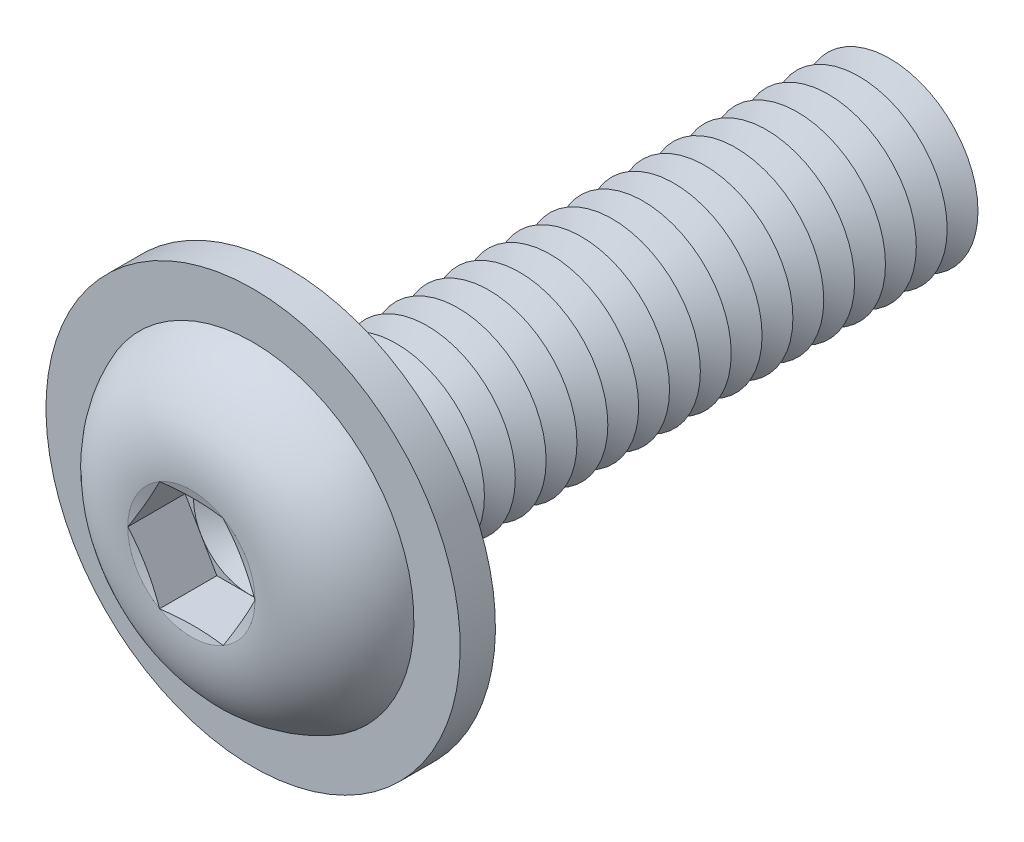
ISO-10303-21;
HEADER;
FILE_DESCRIPTION(('STEP AP214'),'2;1');
FILE_NAME('part.step','',(''),(''),'','','');
FILE_SCHEMA(('AUTOMOTIVE_DESIGN { 1 0 10303 214 1 1 1 1 }'));
ENDSEC;
DATA;
#1=APPLICATION_CONTEXT('core data for automotive mechanical design processes');
#2=APPLICATION_PROTOCOL_DEFINITION('international standard','automotive_design',2000,#1);
#3=PRODUCT_CONTEXT('',#1,'mechanical');
#4=PRODUCT('Part','Part','',(#3));
#5=PRODUCT_RELATED_PRODUCT_CATEGORY('part','',(#4));
#6=PRODUCT_DEFINITION_FORMATION('','',#4);
#7=PRODUCT_DEFINITION_CONTEXT('part definition',#1,'design');
#8=PRODUCT_DEFINITION('design','',#6,#7);
#9=PRODUCT_DEFINITION_SHAPE('','',#8);
#10=(LENGTH_UNIT() NAMED_UNIT(*) SI_UNIT(.MILLI.,.METRE.));
#11=(NAMED_UNIT(*) PLANE_ANGLE_UNIT() SI_UNIT($,.RADIAN.));
#12=(NAMED_UNIT(*) SI_UNIT($,.STERADIAN.) SOLID_ANGLE_UNIT());
#13=UNCERTAINTY_MEASURE_WITH_UNIT(LENGTH_MEASURE(1.E-05),#10,'distance_accuracy_value','');
#14=(GEOMETRIC_REPRESENTATION_CONTEXT(3) GLOBAL_UNCERTAINTY_ASSIGNED_CONTEXT((#13)) GLOBAL_UNIT_ASSIGNED_CONTEXT((#10,
#11,#12)) REPRESENTATION_CONTEXT('',''));
#15=CARTESIAN_POINT('',(0.,0.,0.));
#16=DIRECTION('',(0.,0.,1.));
#17=DIRECTION('',(1.,0.,0.));
#18=AXIS2_PLACEMENT_3D('',#15,#16,#17);
#19=CARTESIAN_POINT('',(0.,0.,-11.55));
#20=DIRECTION('',(0.,0.,1.));
#21=DIRECTION('',(1.,0.,0.));
#22=AXIS2_PLACEMENT_3D('',#19,#20,#21);
#23=CONICAL_SURFACE('',#22,2.,1.0471975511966);
#24=CARTESIAN_POINT('',(0.,0.,-11.9));
#25=DIRECTION('',(0.,0.,1.));
#26=DIRECTION('',(1.,0.,0.));
#27=AXIS2_PLACEMENT_3D('',#24,#25,#26);
#28=CIRCLE('',#27,1.3937822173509);
#29=CARTESIAN_POINT('',(1.3937822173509,0.,-11.9));
#30=VERTEX_POINT('',#29);
#31=EDGE_CURVE('E370',#30,#30,#28,.T.);
#32=ORIENTED_EDGE('',*,*,#31,.T.);
#33=EDGE_LOOP('',(#32));
#34=FACE_BOUND('',#33,.T.);
#35=CARTESIAN_POINT('',(0.,0.,-11.55));
#36=DIRECTION('',(0.,0.,1.));
#37=DIRECTION('',(1.,0.,0.));
#38=AXIS2_PLACEMENT_3D('',#35,#36,#37);
#39=CIRCLE('',#38,2.);
#40=CARTESIAN_POINT('',(2.,0.,-11.55));
#41=VERTEX_POINT('',#40);
#42=EDGE_CURVE('E366',#41,#41,#39,.T.);
#43=ORIENTED_EDGE('',*,*,#42,.F.);
#44=EDGE_LOOP('',(#43));
#45=FACE_BOUND('',#44,.T.);
#46=ADVANCED_FACE('F39',(#34,#45),#23,.T.);
#47=CARTESIAN_POINT('',(0.,0.,-11.9));
#48=DIRECTION('',(0.,0.,-1.));
#49=DIRECTION('',(-1.,0.,0.));
#50=AXIS2_PLACEMENT_3D('',#47,#48,#49);
#51=CONICAL_SURFACE('',#50,1.3937822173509,1.0471975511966);
#52=CARTESIAN_POINT('',(0.,0.,-12.25));
#53=DIRECTION('',(0.,0.,1.));
#54=DIRECTION('',(1.,0.,0.));
#55=AXIS2_PLACEMENT_3D('',#52,#53,#54);
#56=CIRCLE('',#55,2.);
#57=CARTESIAN_POINT('',(2.,0.,-12.25));
#58=VERTEX_POINT('',#57);
#59=EDGE_CURVE('E374',#58,#58,#56,.T.);
#60=ORIENTED_EDGE('',*,*,#59,.T.);
#61=EDGE_LOOP('',(#60));
#62=FACE_BOUND('',#61,.T.);
#63=ORIENTED_EDGE('',*,*,#31,.F.);
#64=EDGE_LOOP('',(#63));
#65=FACE_BOUND('',#64,.T.);
#66=ADVANCED_FACE('F486',(#62,#65),#51,.T.);
#67=CARTESIAN_POINT('',(0.,2.00000000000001,-14.));
#68=DIRECTION('',(0.,0.,-1.));
#69=DIRECTION('',(-1.,0.,0.));
#70=AXIS2_PLACEMENT_3D('',#67,#68,#69);
#71=PLANE('',#70);
#72=CARTESIAN_POINT('',(0.,0.,-14.));
#73=DIRECTION('',(0.,0.,1.));
#74=DIRECTION('',(1.,0.,0.));
#75=AXIS2_PLACEMENT_3D('',#72,#73,#74);
#76=CIRCLE('',#75,1.3937822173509);
#77=CARTESIAN_POINT('',(1.3937822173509,0.,-14.));
#78=VERTEX_POINT('',#77);
#79=EDGE_CURVE('E394',#78,#78,#76,.T.);
#80=ORIENTED_EDGE('',*,*,#79,.F.);
#81=EDGE_LOOP('',(#80));
#82=FACE_BOUND('',#81,.T.);
#83=ADVANCED_FACE('F492',(#82),#71,.T.);
#84=CARTESIAN_POINT('',(0.,0.,-13.65));
#85=DIRECTION('',(0.,0.,1.));
#86=DIRECTION('',(1.,0.,0.));
#87=AXIS2_PLACEMENT_3D('',#84,#85,#86);
#88=CONICAL_SURFACE('',#87,2.,1.0471975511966);
#89=ORIENTED_EDGE('',*,*,#79,.T.);
#90=EDGE_LOOP('',(#89));
#91=FACE_BOUND('',#90,.T.);
#92=CARTESIAN_POINT('',(0.,0.,-13.65));
#93=DIRECTION('',(0.,0.,1.));
#94=DIRECTION('',(1.,0.,0.));
#95=AXIS2_PLACEMENT_3D('',#92,#93,#94);
#96=CIRCLE('',#95,2.);
#97=CARTESIAN_POINT('',(2.,0.,-13.65));
#98=VERTEX_POINT('',#97);
#99=EDGE_CURVE('E390',#98,#98,#96,.T.);
#100=ORIENTED_EDGE('',*,*,#99,.F.);
#101=EDGE_LOOP('',(#100));
#102=FACE_BOUND('',#101,.T.);
#103=ADVANCED_FACE('F511',(#91,#102),#88,.T.);
#104=CARTESIAN_POINT('',(0.,0.,-13.3));
#105=DIRECTION('',(0.,0.,-1.));
#106=DIRECTION('',(-1.,0.,0.));
#107=AXIS2_PLACEMENT_3D('',#104,#105,#106);
#108=CONICAL_SURFACE('',#107,1.3937822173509,1.0471975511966);
#109=ORIENTED_EDGE('',*,*,#99,.T.);
#110=EDGE_LOOP('',(#109));
#111=FACE_BOUND('',#110,.T.);
#112=CARTESIAN_POINT('',(0.,0.,-13.3));
#113=DIRECTION('',(0.,0.,1.));
#114=DIRECTION('',(1.,0.,0.));
#115=AXIS2_PLACEMENT_3D('',#112,#113,#114);
#116=CIRCLE('',#115,1.3937822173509);
#117=CARTESIAN_POINT('',(1.3937822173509,0.,-13.3));
#118=VERTEX_POINT('',#117);
#119=EDGE_CURVE('E386',#118,#118,#116,.T.);
#120=ORIENTED_EDGE('',*,*,#119,.F.);
#121=EDGE_LOOP('',(#120));
#122=FACE_BOUND('',#121,.T.);
#123=ADVANCED_FACE('F508',(#111,#122),#108,.T.);
#124=CARTESIAN_POINT('',(0.,0.,-12.95));
#125=DIRECTION('',(0.,0.,1.));
#126=DIRECTION('',(1.,0.,0.));
#127=AXIS2_PLACEMENT_3D('',#124,#125,#126);
#128=CONICAL_SURFACE('',#127,2.,1.0471975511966);
#129=ORIENTED_EDGE('',*,*,#119,.T.);
#130=EDGE_LOOP('',(#129));
#131=FACE_BOUND('',#130,.T.);
#132=CARTESIAN_POINT('',(0.,0.,-12.95));
#133=DIRECTION('',(0.,0.,1.));
#134=DIRECTION('',(1.,0.,0.));
#135=AXIS2_PLACEMENT_3D('',#132,#133,#134);
#136=CIRCLE('',#135,2.);
#137=CARTESIAN_POINT('',(2.,0.,-12.95));
#138=VERTEX_POINT('',#137);
#139=EDGE_CURVE('E382',#138,#138,#136,.T.);
#140=ORIENTED_EDGE('',*,*,#139,.F.);
#141=EDGE_LOOP('',(#140));
#142=FACE_BOUND('',#141,.T.);
#143=ADVANCED_FACE('F502',(#131,#142),#128,.T.);
#144=CARTESIAN_POINT('',(0.,0.,-12.6));
#145=DIRECTION('',(0.,0.,-1.));
#146=DIRECTION('',(-1.,0.,0.));
#147=AXIS2_PLACEMENT_3D('',#144,#145,#146);
#148=CONICAL_SURFACE('',#147,1.3937822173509,1.0471975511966);
#149=ORIENTED_EDGE('',*,*,#139,.T.);
#150=EDGE_LOOP('',(#149));
#151=FACE_BOUND('',#150,.T.);
#152=CARTESIAN_POINT('',(0.,0.,-12.6));
#153=DIRECTION('',(0.,0.,1.));
#154=DIRECTION('',(1.,0.,0.));
#155=AXIS2_PLACEMENT_3D('',#152,#153,#154);
#156=CIRCLE('',#155,1.3937822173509);
#157=CARTESIAN_POINT('',(1.3937822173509,0.,-12.6));
#158=VERTEX_POINT('',#157);
#159=EDGE_CURVE('E378',#158,#158,#156,.T.);
#160=ORIENTED_EDGE('',*,*,#159,.F.);
#161=EDGE_LOOP('',(#160));
#162=FACE_BOUND('',#161,.T.);
#163=ADVANCED_FACE('F498',(#151,#162),#148,.T.);
#164=CARTESIAN_POINT('',(0.,0.,-12.25));
#165=DIRECTION('',(0.,0.,1.));
#166=DIRECTION('',(1.,0.,0.));
#167=AXIS2_PLACEMENT_3D('',#164,#165,#166);
#168=CONICAL_SURFACE('',#167,2.,1.0471975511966);
#169=ORIENTED_EDGE('',*,*,#159,.T.);
#170=EDGE_LOOP('',(#169));
#171=FACE_BOUND('',#170,.T.);
#172=ORIENTED_EDGE('',*,*,#59,.F.);
#173=EDGE_LOOP('',(#172));
#174=FACE_BOUND('',#173,.T.);
#175=ADVANCED_FACE('F501',(#171,#174),#168,.T.);
#176=CARTESIAN_POINT('',(0.,0.,-10.85));
#177=DIRECTION('',(0.,0.,1.));
#178=DIRECTION('',(1.,0.,0.));
#179=AXIS2_PLACEMENT_3D('',#176,#177,#178);
#180=CONICAL_SURFACE('',#179,2.,1.0471975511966);
#181=CARTESIAN_POINT('',(0.,0.,-11.2));
#182=DIRECTION('',(0.,0.,1.));
#183=DIRECTION('',(1.,0.,0.));
#184=AXIS2_PLACEMENT_3D('',#181,#182,#183);
#185=CIRCLE('',#184,1.3937822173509);
#186=CARTESIAN_POINT('',(1.3937822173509,0.,-11.2));
#187=VERTEX_POINT('',#186);
#188=EDGE_CURVE('E362',#187,#187,#185,.T.);
#189=ORIENTED_EDGE('',*,*,#188,.T.);
#190=EDGE_LOOP('',(#189));
#191=FACE_BOUND('',#190,.T.);
#192=CARTESIAN_POINT('',(0.,0.,-10.85));
#193=DIRECTION('',(0.,0.,1.));
#194=DIRECTION('',(1.,0.,0.));
#195=AXIS2_PLACEMENT_3D('',#192,#193,#194);
#196=CIRCLE('',#195,2.);
#197=CARTESIAN_POINT('',(2.,0.,-10.85));
#198=VERTEX_POINT('',#197);
#199=EDGE_CURVE('E358',#198,#198,#196,.T.);
#200=ORIENTED_EDGE('',*,*,#199,.F.);
#201=EDGE_LOOP('',(#200));
#202=FACE_BOUND('',#201,.T.);
#203=ADVANCED_FACE('F506',(#191,#202),#180,.T.);
#204=CARTESIAN_POINT('',(0.,0.,-11.2));
#205=DIRECTION('',(0.,0.,-1.));
#206=DIRECTION('',(-1.,0.,0.));
#207=AXIS2_PLACEMENT_3D('',#204,#205,#206);
#208=CONICAL_SURFACE('',#207,1.3937822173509,1.0471975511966);
#209=ORIENTED_EDGE('',*,*,#42,.T.);
#210=EDGE_LOOP('',(#209));
#211=FACE_BOUND('',#210,.T.);
#212=ORIENTED_EDGE('',*,*,#188,.F.);
#213=EDGE_LOOP('',(#212));
#214=FACE_BOUND('',#213,.T.);
#215=ADVANCED_FACE('F557',(#211,#214),#208,.T.);
#216=CARTESIAN_POINT('',(0.,0.,-10.15));
#217=DIRECTION('',(0.,0.,1.));
#218=DIRECTION('',(1.,0.,0.));
#219=AXIS2_PLACEMENT_3D('',#216,#217,#218);
#220=CONICAL_SURFACE('',#219,2.,1.0471975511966);
#221=CARTESIAN_POINT('',(0.,0.,-10.5));
#222=DIRECTION('',(0.,0.,1.));
#223=DIRECTION('',(1.,0.,0.));
#224=AXIS2_PLACEMENT_3D('',#221,#222,#223);
#225=CIRCLE('',#224,1.3937822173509);
#226=CARTESIAN_POINT('',(1.3937822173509,0.,-10.5));
#227=VERTEX_POINT('',#226);
#228=EDGE_CURVE('E354',#227,#227,#225,.T.);
#229=ORIENTED_EDGE('',*,*,#228,.T.);
#230=EDGE_LOOP('',(#229));
#231=FACE_BOUND('',#230,.T.);
#232=CARTESIAN_POINT('',(0.,0.,-10.15));
#233=DIRECTION('',(0.,0.,1.));
#234=DIRECTION('',(1.,0.,0.));
#235=AXIS2_PLACEMENT_3D('',#232,#233,#234);
#236=CIRCLE('',#235,2.);
#237=CARTESIAN_POINT('',(2.,0.,-10.15));
#238=VERTEX_POINT('',#237);
#239=EDGE_CURVE('E350',#238,#238,#236,.T.);
#240=ORIENTED_EDGE('',*,*,#239,.F.);
#241=EDGE_LOOP('',(#240));
#242=FACE_BOUND('',#241,.T.);
#243=ADVANCED_FACE('F563',(#231,#242),#220,.T.);
#244=CARTESIAN_POINT('',(0.,0.,-10.5));
#245=DIRECTION('',(0.,0.,-1.));
#246=DIRECTION('',(-1.,0.,0.));
#247=AXIS2_PLACEMENT_3D('',#244,#245,#246);
#248=CONICAL_SURFACE('',#247,1.3937822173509,1.0471975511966);
#249=ORIENTED_EDGE('',*,*,#199,.T.);
#250=EDGE_LOOP('',(#249));
#251=FACE_BOUND('',#250,.T.);
#252=ORIENTED_EDGE('',*,*,#228,.F.);
#253=EDGE_LOOP('',(#252));
#254=FACE_BOUND('',#253,.T.);
#255=ADVANCED_FACE('F570',(#251,#254),#248,.T.);
#256=CARTESIAN_POINT('',(0.,0.,-9.45));
#257=DIRECTION('',(0.,0.,1.));
#258=DIRECTION('',(1.,0.,0.));
#259=AXIS2_PLACEMENT_3D('',#256,#257,#258);
#260=CONICAL_SURFACE('',#259,2.,1.0471975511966);
#261=CARTESIAN_POINT('',(0.,0.,-9.8));
#262=DIRECTION('',(0.,0.,1.));
#263=DIRECTION('',(1.,0.,0.));
#264=AXIS2_PLACEMENT_3D('',#261,#262,#263);
#265=CIRCLE('',#264,1.3937822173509);
#266=CARTESIAN_POINT('',(1.3937822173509,0.,-9.8));
#267=VERTEX_POINT('',#266);
#268=EDGE_CURVE('E346',#267,#267,#265,.T.);
#269=ORIENTED_EDGE('',*,*,#268,.T.);
#270=EDGE_LOOP('',(#269));
#271=FACE_BOUND('',#270,.T.);
#272=CARTESIAN_POINT('',(0.,0.,-9.45));
#273=DIRECTION('',(0.,0.,1.));
#274=DIRECTION('',(1.,0.,0.));
#275=AXIS2_PLACEMENT_3D('',#272,#273,#274);
#276=CIRCLE('',#275,2.);
#277=CARTESIAN_POINT('',(2.,0.,-9.45));
#278=VERTEX_POINT('',#277);
#279=EDGE_CURVE('E342',#278,#278,#276,.T.);
#280=ORIENTED_EDGE('',*,*,#279,.F.);
#281=EDGE_LOOP('',(#280));
#282=FACE_BOUND('',#281,.T.);
#283=ADVANCED_FACE('F577',(#271,#282),#260,.T.);
#284=CARTESIAN_POINT('',(0.,0.,-9.8));
#285=DIRECTION('',(0.,0.,-1.));
#286=DIRECTION('',(-1.,0.,0.));
#287=AXIS2_PLACEMENT_3D('',#284,#285,#286);
#288=CONICAL_SURFACE('',#287,1.3937822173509,1.0471975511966);
#289=ORIENTED_EDGE('',*,*,#239,.T.);
#290=EDGE_LOOP('',(#289));
#291=FACE_BOUND('',#290,.T.);
#292=ORIENTED_EDGE('',*,*,#268,.F.);
#293=EDGE_LOOP('',(#292));
#294=FACE_BOUND('',#293,.T.);
#295=ADVANCED_FACE('F584',(#291,#294),#288,.T.);
#296=CARTESIAN_POINT('',(0.,0.,-8.75));
#297=DIRECTION('',(0.,0.,1.));
#298=DIRECTION('',(1.,0.,0.));
#299=AXIS2_PLACEMENT_3D('',#296,#297,#298);
#300=CONICAL_SURFACE('',#299,2.,1.0471975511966);
#301=CARTESIAN_POINT('',(0.,0.,-9.1));
#302=DIRECTION('',(0.,0.,1.));
#303=DIRECTION('',(1.,0.,0.));
#304=AXIS2_PLACEMENT_3D('',#301,#302,#303);
#305=CIRCLE('',#304,1.3937822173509);
#306=CARTESIAN_POINT('',(1.3937822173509,0.,-9.1));
#307=VERTEX_POINT('',#306);
#308=EDGE_CURVE('E338',#307,#307,#305,.T.);
#309=ORIENTED_EDGE('',*,*,#308,.T.);
#310=EDGE_LOOP('',(#309));
#311=FACE_BOUND('',#310,.T.);
#312=CARTESIAN_POINT('',(0.,0.,-8.75));
#313=DIRECTION('',(0.,0.,1.));
#314=DIRECTION('',(1.,0.,0.));
#315=AXIS2_PLACEMENT_3D('',#312,#313,#314);
#316=CIRCLE('',#315,2.);
#317=CARTESIAN_POINT('',(2.,0.,-8.75));
#318=VERTEX_POINT('',#317);
#319=EDGE_CURVE('E334',#318,#318,#316,.T.);
#320=ORIENTED_EDGE('',*,*,#319,.F.);
#321=EDGE_LOOP('',(#320));
#322=FACE_BOUND('',#321,.T.);
#323=ADVANCED_FACE('F591',(#311,#322),#300,.T.);
#324=CARTESIAN_POINT('',(0.,0.,-9.1));
#325=DIRECTION('',(0.,0.,-1.));
#326=DIRECTION('',(-1.,0.,0.));
#327=AXIS2_PLACEMENT_3D('',#324,#325,#326);
#328=CONICAL_SURFACE('',#327,1.3937822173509,1.0471975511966);
#329=ORIENTED_EDGE('',*,*,#279,.T.);
#330=EDGE_LOOP('',(#329));
#331=FACE_BOUND('',#330,.T.);
#332=ORIENTED_EDGE('',*,*,#308,.F.);
#333=EDGE_LOOP('',(#332));
#334=FACE_BOUND('',#333,.T.);
#335=ADVANCED_FACE('F598',(#331,#334),#328,.T.);
#336=CARTESIAN_POINT('',(0.,0.,-8.05));
#337=DIRECTION('',(0.,0.,1.));
#338=DIRECTION('',(1.,0.,0.));
#339=AXIS2_PLACEMENT_3D('',#336,#337,#338);
#340=CONICAL_SURFACE('',#339,2.,1.0471975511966);
#341=CARTESIAN_POINT('',(0.,0.,-8.4));
#342=DIRECTION('',(0.,0.,1.));
#343=DIRECTION('',(1.,0.,0.));
#344=AXIS2_PLACEMENT_3D('',#341,#342,#343);
#345=CIRCLE('',#344,1.3937822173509);
#346=CARTESIAN_POINT('',(1.3937822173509,0.,-8.4));
#347=VERTEX_POINT('',#346);
#348=EDGE_CURVE('E330',#347,#347,#345,.T.);
#349=ORIENTED_EDGE('',*,*,#348,.T.);
#350=EDGE_LOOP('',(#349));
#351=FACE_BOUND('',#350,.T.);
#352=CARTESIAN_POINT('',(0.,0.,-8.05));
#353=DIRECTION('',(0.,0.,1.));
#354=DIRECTION('',(1.,0.,0.));
#355=AXIS2_PLACEMENT_3D('',#352,#353,#354);
#356=CIRCLE('',#355,2.);
#357=CARTESIAN_POINT('',(2.,0.,-8.05));
#358=VERTEX_POINT('',#357);
#359=EDGE_CURVE('E326',#358,#358,#356,.T.);
#360=ORIENTED_EDGE('',*,*,#359,.F.);
#361=EDGE_LOOP('',(#360));
#362=FACE_BOUND('',#361,.T.);
#363=ADVANCED_FACE('F605',(#351,#362),#340,.T.);
#364=CARTESIAN_POINT('',(0.,0.,-8.4));
#365=DIRECTION('',(0.,0.,-1.));
#366=DIRECTION('',(-1.,0.,0.));
#367=AXIS2_PLACEMENT_3D('',#364,#365,#366);
#368=CONICAL_SURFACE('',#367,1.3937822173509,1.0471975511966);
#369=ORIENTED_EDGE('',*,*,#319,.T.);
#370=EDGE_LOOP('',(#369));
#371=FACE_BOUND('',#370,.T.);
#372=ORIENTED_EDGE('',*,*,#348,.F.);
#373=EDGE_LOOP('',(#372));
#374=FACE_BOUND('',#373,.T.);
#375=ADVANCED_FACE('F612',(#371,#374),#368,.T.);
#376=CARTESIAN_POINT('',(0.,0.,-7.35));
#377=DIRECTION('',(0.,0.,1.));
#378=DIRECTION('',(1.,0.,0.));
#379=AXIS2_PLACEMENT_3D('',#376,#377,#378);
#380=CONICAL_SURFACE('',#379,2.,1.0471975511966);
#381=CARTESIAN_POINT('',(0.,0.,-7.7));
#382=DIRECTION('',(0.,0.,1.));
#383=DIRECTION('',(1.,0.,0.));
#384=AXIS2_PLACEMENT_3D('',#381,#382,#383);
#385=CIRCLE('',#384,1.3937822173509);
#386=CARTESIAN_POINT('',(1.3937822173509,0.,-7.7));
#387=VERTEX_POINT('',#386);
#388=EDGE_CURVE('E322',#387,#387,#385,.T.);
#389=ORIENTED_EDGE('',*,*,#388,.T.);
#390=EDGE_LOOP('',(#389));
#391=FACE_BOUND('',#390,.T.);
#392=CARTESIAN_POINT('',(0.,0.,-7.35));
#393=DIRECTION('',(0.,0.,1.));
#394=DIRECTION('',(1.,0.,0.));
#395=AXIS2_PLACEMENT_3D('',#392,#393,#394);
#396=CIRCLE('',#395,2.);
#397=CARTESIAN_POINT('',(2.,0.,-7.35));
#398=VERTEX_POINT('',#397);
#399=EDGE_CURVE('E318',#398,#398,#396,.T.);
#400=ORIENTED_EDGE('',*,*,#399,.F.);
#401=EDGE_LOOP('',(#400));
#402=FACE_BOUND('',#401,.T.);
#403=ADVANCED_FACE('F619',(#391,#402),#380,.T.);
#404=CARTESIAN_POINT('',(0.,0.,-7.7));
#405=DIRECTION('',(0.,0.,-1.));
#406=DIRECTION('',(-1.,0.,0.));
#407=AXIS2_PLACEMENT_3D('',#404,#405,#406);
#408=CONICAL_SURFACE('',#407,1.3937822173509,1.0471975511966);
#409=ORIENTED_EDGE('',*,*,#359,.T.);
#410=EDGE_LOOP('',(#409));
#411=FACE_BOUND('',#410,.T.);
#412=ORIENTED_EDGE('',*,*,#388,.F.);
#413=EDGE_LOOP('',(#412));
#414=FACE_BOUND('',#413,.T.);
#415=ADVANCED_FACE('F626',(#411,#414),#408,.T.);
#416=CARTESIAN_POINT('',(0.,0.,-6.65));
#417=DIRECTION('',(0.,0.,1.));
#418=DIRECTION('',(1.,0.,0.));
#419=AXIS2_PLACEMENT_3D('',#416,#417,#418);
#420=CONICAL_SURFACE('',#419,2.,1.0471975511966);
#421=CARTESIAN_POINT('',(0.,0.,-7.));
#422=DIRECTION('',(0.,0.,1.));
#423=DIRECTION('',(1.,0.,0.));
#424=AXIS2_PLACEMENT_3D('',#421,#422,#423);
#425=CIRCLE('',#424,1.3937822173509);
#426=CARTESIAN_POINT('',(1.3937822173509,0.,-7.));
#427=VERTEX_POINT('',#426);
#428=EDGE_CURVE('E314',#427,#427,#425,.T.);
#429=ORIENTED_EDGE('',*,*,#428,.T.);
#430=EDGE_LOOP('',(#429));
#431=FACE_BOUND('',#430,.T.);
#432=CARTESIAN_POINT('',(0.,0.,-6.65));
#433=DIRECTION('',(0.,0.,1.));
#434=DIRECTION('',(1.,0.,0.));
#435=AXIS2_PLACEMENT_3D('',#432,#433,#434);
#436=CIRCLE('',#435,2.);
#437=CARTESIAN_POINT('',(2.,0.,-6.65));
#438=VERTEX_POINT('',#437);
#439=EDGE_CURVE('E310',#438,#438,#436,.T.);
#440=ORIENTED_EDGE('',*,*,#439,.F.);
#441=EDGE_LOOP('',(#440));
#442=FACE_BOUND('',#441,.T.);
#443=ADVANCED_FACE('F633',(#431,#442),#420,.T.);
#444=CARTESIAN_POINT('',(0.,0.,-7.));
#445=DIRECTION('',(0.,0.,-1.));
#446=DIRECTION('',(-1.,0.,0.));
#447=AXIS2_PLACEMENT_3D('',#444,#445,#446);
#448=CONICAL_SURFACE('',#447,1.3937822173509,1.0471975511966);
#449=ORIENTED_EDGE('',*,*,#399,.T.);
#450=EDGE_LOOP('',(#449));
#451=FACE_BOUND('',#450,.T.);
#452=ORIENTED_EDGE('',*,*,#428,.F.);
#453=EDGE_LOOP('',(#452));
#454=FACE_BOUND('',#453,.T.);
#455=ADVANCED_FACE('F640',(#451,#454),#448,.T.);
#456=CARTESIAN_POINT('',(0.,0.,-5.95));
#457=DIRECTION('',(0.,0.,1.));
#458=DIRECTION('',(1.,0.,0.));
#459=AXIS2_PLACEMENT_3D('',#456,#457,#458);
#460=CONICAL_SURFACE('',#459,2.,1.0471975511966);
#461=CARTESIAN_POINT('',(0.,0.,-6.3));
#462=DIRECTION('',(0.,0.,1.));
#463=DIRECTION('',(1.,0.,0.));
#464=AXIS2_PLACEMENT_3D('',#461,#462,#463);
#465=CIRCLE('',#464,1.3937822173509);
#466=CARTESIAN_POINT('',(1.3937822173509,0.,-6.3));
#467=VERTEX_POINT('',#466);
#468=EDGE_CURVE('E306',#467,#467,#465,.T.);
#469=ORIENTED_EDGE('',*,*,#468,.T.);
#470=EDGE_LOOP('',(#469));
#471=FACE_BOUND('',#470,.T.);
#472=CARTESIAN_POINT('',(0.,0.,-5.95));
#473=DIRECTION('',(0.,0.,1.));
#474=DIRECTION('',(1.,0.,0.));
#475=AXIS2_PLACEMENT_3D('',#472,#473,#474);
#476=CIRCLE('',#475,2.);
#477=CARTESIAN_POINT('',(2.,0.,-5.95));
#478=VERTEX_POINT('',#477);
#479=EDGE_CURVE('E302',#478,#478,#476,.T.);
#480=ORIENTED_EDGE('',*,*,#479,.F.);
#481=EDGE_LOOP('',(#480));
#482=FACE_BOUND('',#481,.T.);
#483=ADVANCED_FACE('F647',(#471,#482),#460,.T.);
#484=CARTESIAN_POINT('',(0.,0.,-6.3));
#485=DIRECTION('',(0.,0.,-1.));
#486=DIRECTION('',(-1.,0.,0.));
#487=AXIS2_PLACEMENT_3D('',#484,#485,#486);
#488=CONICAL_SURFACE('',#487,1.3937822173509,1.0471975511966);
#489=ORIENTED_EDGE('',*,*,#439,.T.);
#490=EDGE_LOOP('',(#489));
#491=FACE_BOUND('',#490,.T.);
#492=ORIENTED_EDGE('',*,*,#468,.F.);
#493=EDGE_LOOP('',(#492));
#494=FACE_BOUND('',#493,.T.);
#495=ADVANCED_FACE('F654',(#491,#494),#488,.T.);
#496=CARTESIAN_POINT('',(0.,0.,-5.25));
#497=DIRECTION('',(0.,0.,1.));
#498=DIRECTION('',(1.,0.,0.));
#499=AXIS2_PLACEMENT_3D('',#496,#497,#498);
#500=CONICAL_SURFACE('',#499,2.,1.0471975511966);
#501=CARTESIAN_POINT('',(0.,0.,-5.6));
#502=DIRECTION('',(0.,0.,1.));
#503=DIRECTION('',(1.,0.,0.));
#504=AXIS2_PLACEMENT_3D('',#501,#502,#503);
#505=CIRCLE('',#504,1.3937822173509);
#506=CARTESIAN_POINT('',(1.3937822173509,0.,-5.6));
#507=VERTEX_POINT('',#506);
#508=EDGE_CURVE('E298',#507,#507,#505,.T.);
#509=ORIENTED_EDGE('',*,*,#508,.T.);
#510=EDGE_LOOP('',(#509));
#511=FACE_BOUND('',#510,.T.);
#512=CARTESIAN_POINT('',(0.,0.,-5.25));
#513=DIRECTION('',(0.,0.,1.));
#514=DIRECTION('',(1.,0.,0.));
#515=AXIS2_PLACEMENT_3D('',#512,#513,#514);
#516=CIRCLE('',#515,2.);
#517=CARTESIAN_POINT('',(2.,0.,-5.25));
#518=VERTEX_POINT('',#517);
#519=EDGE_CURVE('E294',#518,#518,#516,.T.);
#520=ORIENTED_EDGE('',*,*,#519,.F.);
#521=EDGE_LOOP('',(#520));
#522=FACE_BOUND('',#521,.T.);
#523=ADVANCED_FACE('F661',(#511,#522),#500,.T.);
#524=CARTESIAN_POINT('',(0.,0.,-5.6));
#525=DIRECTION('',(0.,0.,-1.));
#526=DIRECTION('',(-1.,0.,0.));
#527=AXIS2_PLACEMENT_3D('',#524,#525,#526);
#528=CONICAL_SURFACE('',#527,1.3937822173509,1.0471975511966);
#529=ORIENTED_EDGE('',*,*,#479,.T.);
#530=EDGE_LOOP('',(#529));
#531=FACE_BOUND('',#530,.T.);
#532=ORIENTED_EDGE('',*,*,#508,.F.);
#533=EDGE_LOOP('',(#532));
#534=FACE_BOUND('',#533,.T.);
#535=ADVANCED_FACE('F668',(#531,#534),#528,.T.);
#536=CARTESIAN_POINT('',(0.,0.,-4.55));
#537=DIRECTION('',(0.,0.,1.));
#538=DIRECTION('',(1.,0.,0.));
#539=AXIS2_PLACEMENT_3D('',#536,#537,#538);
#540=CONICAL_SURFACE('',#539,2.,1.0471975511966);
#541=CARTESIAN_POINT('',(0.,0.,-4.9));
#542=DIRECTION('',(0.,0.,1.));
#543=DIRECTION('',(1.,0.,0.));
#544=AXIS2_PLACEMENT_3D('',#541,#542,#543);
#545=CIRCLE('',#544,1.3937822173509);
#546=CARTESIAN_POINT('',(1.3937822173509,0.,-4.9));
#547=VERTEX_POINT('',#546);
#548=EDGE_CURVE('E290',#547,#547,#545,.T.);
#549=ORIENTED_EDGE('',*,*,#548,.T.);
#550=EDGE_LOOP('',(#549));
#551=FACE_BOUND('',#550,.T.);
#552=CARTESIAN_POINT('',(0.,0.,-4.55));
#553=DIRECTION('',(0.,0.,1.));
#554=DIRECTION('',(1.,0.,0.));
#555=AXIS2_PLACEMENT_3D('',#552,#553,#554);
#556=CIRCLE('',#555,2.);
#557=CARTESIAN_POINT('',(2.,0.,-4.55));
#558=VERTEX_POINT('',#557);
#559=EDGE_CURVE('E286',#558,#558,#556,.T.);
#560=ORIENTED_EDGE('',*,*,#559,.F.);
#561=EDGE_LOOP('',(#560));
#562=FACE_BOUND('',#561,.T.);
#563=ADVANCED_FACE('F675',(#551,#562),#540,.T.);
#564=CARTESIAN_POINT('',(0.,0.,-4.9));
#565=DIRECTION('',(0.,0.,-1.));
#566=DIRECTION('',(-1.,0.,0.));
#567=AXIS2_PLACEMENT_3D('',#564,#565,#566);
#568=CONICAL_SURFACE('',#567,1.3937822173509,1.0471975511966);
#569=ORIENTED_EDGE('',*,*,#519,.T.);
#570=EDGE_LOOP('',(#569));
#571=FACE_BOUND('',#570,.T.);
#572=ORIENTED_EDGE('',*,*,#548,.F.);
#573=EDGE_LOOP('',(#572));
#574=FACE_BOUND('',#573,.T.);
#575=ADVANCED_FACE('F682',(#571,#574),#568,.T.);
#576=CARTESIAN_POINT('',(0.,0.,-3.85));
#577=DIRECTION('',(0.,0.,1.));
#578=DIRECTION('',(1.,0.,0.));
#579=AXIS2_PLACEMENT_3D('',#576,#577,#578);
#580=CONICAL_SURFACE('',#579,2.,1.0471975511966);
#581=CARTESIAN_POINT('',(0.,0.,-4.2));
#582=DIRECTION('',(0.,0.,1.));
#583=DIRECTION('',(1.,0.,0.));
#584=AXIS2_PLACEMENT_3D('',#581,#582,#583);
#585=CIRCLE('',#584,1.3937822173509);
#586=CARTESIAN_POINT('',(1.3937822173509,0.,-4.2));
#587=VERTEX_POINT('',#586);
#588=EDGE_CURVE('E282',#587,#587,#585,.T.);
#589=ORIENTED_EDGE('',*,*,#588,.T.);
#590=EDGE_LOOP('',(#589));
#591=FACE_BOUND('',#590,.T.);
#592=CARTESIAN_POINT('',(0.,0.,-3.85));
#593=DIRECTION('',(0.,0.,1.));
#594=DIRECTION('',(1.,0.,0.));
#595=AXIS2_PLACEMENT_3D('',#592,#593,#594);
#596=CIRCLE('',#595,2.);
#597=CARTESIAN_POINT('',(2.,0.,-3.85));
#598=VERTEX_POINT('',#597);
#599=EDGE_CURVE('E278',#598,#598,#596,.T.);
#600=ORIENTED_EDGE('',*,*,#599,.F.);
#601=EDGE_LOOP('',(#600));
#602=FACE_BOUND('',#601,.T.);
#603=ADVANCED_FACE('F689',(#591,#602),#580,.T.);
#604=CARTESIAN_POINT('',(0.,0.,-4.2));
#605=DIRECTION('',(0.,0.,-1.));
#606=DIRECTION('',(-1.,0.,0.));
#607=AXIS2_PLACEMENT_3D('',#604,#605,#606);
#608=CONICAL_SURFACE('',#607,1.3937822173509,1.0471975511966);
#609=ORIENTED_EDGE('',*,*,#559,.T.);
#610=EDGE_LOOP('',(#609));
#611=FACE_BOUND('',#610,.T.);
#612=ORIENTED_EDGE('',*,*,#588,.F.);
#613=EDGE_LOOP('',(#612));
#614=FACE_BOUND('',#613,.T.);
#615=ADVANCED_FACE('F696',(#611,#614),#608,.T.);
#616=CARTESIAN_POINT('',(0.,0.,-3.15));
#617=DIRECTION('',(0.,0.,1.));
#618=DIRECTION('',(1.,0.,0.));
#619=AXIS2_PLACEMENT_3D('',#616,#617,#618);
#620=CONICAL_SURFACE('',#619,2.,1.0471975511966);
#621=CARTESIAN_POINT('',(0.,0.,-3.5));
#622=DIRECTION('',(0.,0.,1.));
#623=DIRECTION('',(1.,0.,0.));
#624=AXIS2_PLACEMENT_3D('',#621,#622,#623);
#625=CIRCLE('',#624,1.3937822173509);
#626=CARTESIAN_POINT('',(1.3937822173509,0.,-3.5));
#627=VERTEX_POINT('',#626);
#628=EDGE_CURVE('E274',#627,#627,#625,.T.);
#629=ORIENTED_EDGE('',*,*,#628,.T.);
#630=EDGE_LOOP('',(#629));
#631=FACE_BOUND('',#630,.T.);
#632=CARTESIAN_POINT('',(0.,0.,-3.15));
#633=DIRECTION('',(0.,0.,1.));
#634=DIRECTION('',(1.,0.,0.));
#635=AXIS2_PLACEMENT_3D('',#632,#633,#634);
#636=CIRCLE('',#635,2.);
#637=CARTESIAN_POINT('',(2.,0.,-3.15));
#638=VERTEX_POINT('',#637);
#639=EDGE_CURVE('E270',#638,#638,#636,.T.);
#640=ORIENTED_EDGE('',*,*,#639,.F.);
#641=EDGE_LOOP('',(#640));
#642=FACE_BOUND('',#641,.T.);
#643=ADVANCED_FACE('F703',(#631,#642),#620,.T.);
#644=CARTESIAN_POINT('',(0.,0.,-3.5));
#645=DIRECTION('',(0.,0.,-1.));
#646=DIRECTION('',(-1.,0.,0.));
#647=AXIS2_PLACEMENT_3D('',#644,#645,#646);
#648=CONICAL_SURFACE('',#647,1.3937822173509,1.0471975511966);
#649=ORIENTED_EDGE('',*,*,#599,.T.);
#650=EDGE_LOOP('',(#649));
#651=FACE_BOUND('',#650,.T.);
#652=ORIENTED_EDGE('',*,*,#628,.F.);
#653=EDGE_LOOP('',(#652));
#654=FACE_BOUND('',#653,.T.);
#655=ADVANCED_FACE('F710',(#651,#654),#648,.T.);
#656=CARTESIAN_POINT('',(0.,0.,-2.45));
#657=DIRECTION('',(0.,0.,1.));
#658=DIRECTION('',(1.,0.,0.));
#659=AXIS2_PLACEMENT_3D('',#656,#657,#658);
#660=CONICAL_SURFACE('',#659,2.,1.0471975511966);
#661=CARTESIAN_POINT('',(0.,0.,-2.8));
#662=DIRECTION('',(0.,0.,1.));
#663=DIRECTION('',(1.,0.,0.));
#664=AXIS2_PLACEMENT_3D('',#661,#662,#663);
#665=CIRCLE('',#664,1.3937822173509);
#666=CARTESIAN_POINT('',(1.3937822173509,0.,-2.8));
#667=VERTEX_POINT('',#666);
#668=EDGE_CURVE('E266',#667,#667,#665,.T.);
#669=ORIENTED_EDGE('',*,*,#668,.T.);
#670=EDGE_LOOP('',(#669));
#671=FACE_BOUND('',#670,.T.);
#672=CARTESIAN_POINT('',(0.,0.,-2.45));
#673=DIRECTION('',(0.,0.,1.));
#674=DIRECTION('',(1.,0.,0.));
#675=AXIS2_PLACEMENT_3D('',#672,#673,#674);
#676=CIRCLE('',#675,2.);
#677=CARTESIAN_POINT('',(2.,0.,-2.45));
#678=VERTEX_POINT('',#677);
#679=EDGE_CURVE('E262',#678,#678,#676,.T.);
#680=ORIENTED_EDGE('',*,*,#679,.F.);
#681=EDGE_LOOP('',(#680));
#682=FACE_BOUND('',#681,.T.);
#683=ADVANCED_FACE('F717',(#671,#682),#660,.T.);
#684=CARTESIAN_POINT('',(0.,0.,-2.8));
#685=DIRECTION('',(0.,0.,-1.));
#686=DIRECTION('',(-1.,0.,0.));
#687=AXIS2_PLACEMENT_3D('',#684,#685,#686);
#688=CONICAL_SURFACE('',#687,1.3937822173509,1.0471975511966);
#689=ORIENTED_EDGE('',*,*,#639,.T.);
#690=EDGE_LOOP('',(#689));
#691=FACE_BOUND('',#690,.T.);
#692=ORIENTED_EDGE('',*,*,#668,.F.);
#693=EDGE_LOOP('',(#692));
#694=FACE_BOUND('',#693,.T.);
#695=ADVANCED_FACE('F724',(#691,#694),#688,.T.);
#696=CARTESIAN_POINT('',(0.,0.,-1.75));
#697=DIRECTION('',(0.,0.,1.));
#698=DIRECTION('',(1.,0.,0.));
#699=AXIS2_PLACEMENT_3D('',#696,#697,#698);
#700=CONICAL_SURFACE('',#699,2.,1.0471975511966);
#701=CARTESIAN_POINT('',(0.,0.,-2.1));
#702=DIRECTION('',(0.,0.,1.));
#703=DIRECTION('',(1.,0.,0.));
#704=AXIS2_PLACEMENT_3D('',#701,#702,#703);
#705=CIRCLE('',#704,1.3937822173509);
#706=CARTESIAN_POINT('',(1.3937822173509,0.,-2.1));
#707=VERTEX_POINT('',#706);
#708=EDGE_CURVE('E258',#707,#707,#705,.T.);
#709=ORIENTED_EDGE('',*,*,#708,.T.);
#710=EDGE_LOOP('',(#709));
#711=FACE_BOUND('',#710,.T.);
#712=CARTESIAN_POINT('',(0.,0.,-1.75));
#713=DIRECTION('',(0.,0.,1.));
#714=DIRECTION('',(1.,0.,0.));
#715=AXIS2_PLACEMENT_3D('',#712,#713,#714);
#716=CIRCLE('',#715,2.);
#717=CARTESIAN_POINT('',(2.,0.,-1.75));
#718=VERTEX_POINT('',#717);
#719=EDGE_CURVE('E254',#718,#718,#716,.T.);
#720=ORIENTED_EDGE('',*,*,#719,.F.);
#721=EDGE_LOOP('',(#720));
#722=FACE_BOUND('',#721,.T.);
#723=ADVANCED_FACE('F731',(#711,#722),#700,.T.);
#724=CARTESIAN_POINT('',(0.,0.,-2.1));
#725=DIRECTION('',(0.,0.,-1.));
#726=DIRECTION('',(-1.,0.,0.));
#727=AXIS2_PLACEMENT_3D('',#724,#725,#726);
#728=CONICAL_SURFACE('',#727,1.3937822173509,1.0471975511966);
#729=ORIENTED_EDGE('',*,*,#679,.T.);
#730=EDGE_LOOP('',(#729));
#731=FACE_BOUND('',#730,.T.);
#732=ORIENTED_EDGE('',*,*,#708,.F.);
#733=EDGE_LOOP('',(#732));
#734=FACE_BOUND('',#733,.T.);
#735=ADVANCED_FACE('F738',(#731,#734),#728,.T.);
#736=CARTESIAN_POINT('',(0.,0.,-1.05));
#737=DIRECTION('',(0.,0.,1.));
#738=DIRECTION('',(1.,0.,0.));
#739=AXIS2_PLACEMENT_3D('',#736,#737,#738);
#740=CONICAL_SURFACE('',#739,2.,1.0471975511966);
#741=CARTESIAN_POINT('',(0.,0.,-1.4));
#742=DIRECTION('',(0.,0.,1.));
#743=DIRECTION('',(1.,0.,0.));
#744=AXIS2_PLACEMENT_3D('',#741,#742,#743);
#745=CIRCLE('',#744,1.3937822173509);
#746=CARTESIAN_POINT('',(1.3937822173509,0.,-1.4));
#747=VERTEX_POINT('',#746);
#748=EDGE_CURVE('E250',#747,#747,#745,.T.);
#749=ORIENTED_EDGE('',*,*,#748,.T.);
#750=EDGE_LOOP('',(#749));
#751=FACE_BOUND('',#750,.T.);
#752=CARTESIAN_POINT('',(0.,0.,-1.05));
#753=DIRECTION('',(0.,0.,1.));
#754=DIRECTION('',(1.,0.,0.));
#755=AXIS2_PLACEMENT_3D('',#752,#753,#754);
#756=CIRCLE('',#755,2.);
#757=CARTESIAN_POINT('',(2.,0.,-1.05));
#758=VERTEX_POINT('',#757);
#759=EDGE_CURVE('E242',#758,#758,#756,.T.);
#760=ORIENTED_EDGE('',*,*,#759,.F.);
#761=EDGE_LOOP('',(#760));
#762=FACE_BOUND('',#761,.T.);
#763=ADVANCED_FACE('F745',(#751,#762),#740,.T.);
#764=CARTESIAN_POINT('',(0.,0.,-1.4));
#765=DIRECTION('',(0.,0.,-1.));
#766=DIRECTION('',(-1.,0.,0.));
#767=AXIS2_PLACEMENT_3D('',#764,#765,#766);
#768=CONICAL_SURFACE('',#767,1.3937822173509,1.0471975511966);
#769=ORIENTED_EDGE('',*,*,#719,.T.);
#770=EDGE_LOOP('',(#769));
#771=FACE_BOUND('',#770,.T.);
#772=ORIENTED_EDGE('',*,*,#748,.F.);
#773=EDGE_LOOP('',(#772));
#774=FACE_BOUND('',#773,.T.);
#775=ADVANCED_FACE('F752',(#771,#774),#768,.T.);
#776=CARTESIAN_POINT('',(0.,0.,-0.35));
#777=DIRECTION('',(0.,0.,1.));
#778=DIRECTION('',(1.,0.,0.));
#779=AXIS2_PLACEMENT_3D('',#776,#777,#778);
#780=CONICAL_SURFACE('',#779,2.,1.0471975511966);
#781=CARTESIAN_POINT('',(0.,0.,-0.699999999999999));
#782=DIRECTION('',(0.,0.,1.));
#783=DIRECTION('',(1.,0.,0.));
#784=AXIS2_PLACEMENT_3D('',#781,#782,#783);
#785=CIRCLE('',#784,1.3937822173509);
#786=CARTESIAN_POINT('',(1.3937822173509,0.,-0.699999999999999));
#787=VERTEX_POINT('',#786);
#788=EDGE_CURVE('E231',#787,#787,#785,.T.);
#789=ORIENTED_EDGE('',*,*,#788,.T.);
#790=EDGE_LOOP('',(#789));
#791=FACE_BOUND('',#790,.T.);
#792=CARTESIAN_POINT('',(0.,0.,-0.35));
#793=DIRECTION('',(0.,0.,1.));
#794=DIRECTION('',(1.,0.,0.));
#795=AXIS2_PLACEMENT_3D('',#792,#793,#794);
#796=CIRCLE('',#795,2.);
#797=CARTESIAN_POINT('',(2.,0.,-0.35));
#798=VERTEX_POINT('',#797);
#799=EDGE_CURVE('E246',#798,#798,#796,.T.);
#800=ORIENTED_EDGE('',*,*,#799,.F.);
#801=EDGE_LOOP('',(#800));
#802=FACE_BOUND('',#801,.T.);
#803=ADVANCED_FACE('F759',(#791,#802),#780,.T.);
#804=CARTESIAN_POINT('',(0.,0.,-0.699999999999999));
#805=DIRECTION('',(0.,0.,-1.));
#806=DIRECTION('',(-1.,0.,0.));
#807=AXIS2_PLACEMENT_3D('',#804,#805,#806);
#808=CONICAL_SURFACE('',#807,1.3937822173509,1.0471975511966);
#809=ORIENTED_EDGE('',*,*,#759,.T.);
#810=EDGE_LOOP('',(#809));
#811=FACE_BOUND('',#810,.T.);
#812=ORIENTED_EDGE('',*,*,#788,.F.);
#813=EDGE_LOOP('',(#812));
#814=FACE_BOUND('',#813,.T.);
#815=ADVANCED_FACE('F220',(#811,#814),#808,.T.);
#816=CARTESIAN_POINT('',(0.,2.,0.));
#817=DIRECTION('',(0.,0.,-1.));
#818=DIRECTION('',(-1.,0.,0.));
#819=AXIS2_PLACEMENT_3D('',#816,#817,#818);
#820=PLANE('',#819);
#821=CARTESIAN_POINT('',(0.,0.,0.));
#822=DIRECTION('',(0.,0.,-1.));
#823=DIRECTION('',(-1.,0.,0.));
#824=AXIS2_PLACEMENT_3D('',#821,#822,#823);
#825=CIRCLE('',#824,2.35);
#826=CARTESIAN_POINT('',(-2.35,0.,0.));
#827=VERTEX_POINT('',#826);
#828=EDGE_CURVE('E403',#827,#827,#825,.F.);
#829=ORIENTED_EDGE('',*,*,#828,.T.);
#830=EDGE_LOOP('',(#829));
#831=FACE_BOUND('',#830,.T.);
#832=CARTESIAN_POINT('',(0.,0.,0.));
#833=DIRECTION('',(0.,0.,-1.));
#834=DIRECTION('',(0.,1.,0.));
#835=AXIS2_PLACEMENT_3D('',#832,#833,#834);
#836=CIRCLE('',#835,4.7);
#837=CARTESIAN_POINT('',(0.,4.7,0.));
#838=VERTEX_POINT('',#837);
#839=EDGE_CURVE('E462',#838,#838,#836,.T.);
#840=ORIENTED_EDGE('',*,*,#839,.T.);
#841=EDGE_LOOP('',(#840));
#842=FACE_BOUND('',#841,.T.);
#843=ADVANCED_FACE('F771',(#831,#842),#820,.T.);
#844=CARTESIAN_POINT('',(0.,0.,-0.35));
#845=DIRECTION('',(0.,0.,-1.));
#846=DIRECTION('',(-1.,0.,0.));
#847=AXIS2_PLACEMENT_3D('',#844,#845,#846);
#848=TOROIDAL_SURFACE('',#847,2.35,0.35);
#849=ORIENTED_EDGE('',*,*,#828,.F.);
#850=EDGE_LOOP('',(#849));
#851=FACE_BOUND('',#850,.T.);
#852=ORIENTED_EDGE('',*,*,#799,.T.);
#853=EDGE_LOOP('',(#852));
#854=FACE_BOUND('',#853,.T.);
#855=ADVANCED_FACE('F41',(#851,#854),#848,.F.);
#856=CARTESIAN_POINT('',(0.,0.,0.8));
#857=DIRECTION('',(0.,0.,-1.));
#858=DIRECTION('',(0.,1.,0.));
#859=AXIS2_PLACEMENT_3D('',#856,#857,#858);
#860=CYLINDRICAL_SURFACE('',#859,4.7);
#861=CARTESIAN_POINT('',(0.,0.,0.8));
#862=DIRECTION('',(0.,0.,-1.));
#863=DIRECTION('',(0.,1.,0.));
#864=AXIS2_PLACEMENT_3D('',#861,#862,#863);
#865=CIRCLE('',#864,4.7);
#866=CARTESIAN_POINT('',(0.,4.7,0.8));
#867=VERTEX_POINT('',#866);
#868=EDGE_CURVE('E464',#867,#867,#865,.T.);
#869=ORIENTED_EDGE('',*,*,#868,.T.);
#870=EDGE_LOOP('',(#869));
#871=FACE_BOUND('',#870,.T.);
#872=ORIENTED_EDGE('',*,*,#839,.F.);
#873=EDGE_LOOP('',(#872));
#874=FACE_BOUND('',#873,.T.);
#875=ADVANCED_FACE('F479',(#871,#874),#860,.T.);
#876=CARTESIAN_POINT('',(0.,0.,0.8));
#877=DIRECTION('',(0.,0.,-1.));
#878=DIRECTION('',(0.,1.,0.));
#879=AXIS2_PLACEMENT_3D('',#876,#877,#878);
#880=PLANE('',#879);
#881=CARTESIAN_POINT('',(0.,0.,0.8));
#882=DIRECTION('',(0.,0.,-1.));
#883=DIRECTION('',(0.,1.,0.));
#884=AXIS2_PLACEMENT_3D('',#881,#882,#883);
#885=CIRCLE('',#884,3.64977164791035);
#886=CARTESIAN_POINT('',(0.,3.64977164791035,0.8));
#887=VERTEX_POINT('',#886);
#888=EDGE_CURVE('E43',#887,#887,#885,.F.);
#889=ORIENTED_EDGE('',*,*,#888,.F.);
#890=EDGE_LOOP('',(#889));
#891=FACE_BOUND('',#890,.T.);
#892=ORIENTED_EDGE('',*,*,#868,.F.);
#893=EDGE_LOOP('',(#892));
#894=FACE_BOUND('',#893,.T.);
#895=ADVANCED_FACE('F117',(#891,#894),#880,.F.);
#896=CARTESIAN_POINT('',(0.,0.,0.9));
#897=DIRECTION('',(0.,0.,1.));
#898=DIRECTION('',(1.,0.,0.));
#899=AXIS2_PLACEMENT_3D('',#896,#897,#898);
#900=CONICAL_SURFACE('',#899,1.24999941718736,1.0471975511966);
#901=CARTESIAN_POINT('',(0.,0.,0.178312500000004));
#902=VERTEX_POINT('',#901);
#903=VERTEX_LOOP('',#902);
#904=FACE_BOUND('',#903,.T.);
#905=CARTESIAN_POINT('',(0.,0.,0.9));
#906=DIRECTION('',(0.,0.,1.));
#907=DIRECTION('',(1.,0.,0.));
#908=AXIS2_PLACEMENT_3D('',#905,#906,#907);
#909=CIRCLE('',#908,1.24999941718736);
#910=CARTESIAN_POINT('',(1.08253125,0.624999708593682,0.9));
#911=VERTEX_POINT('',#910);
#912=CARTESIAN_POINT('',(0.,1.24999941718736,0.9));
#913=VERTEX_POINT('',#912);
#914=EDGE_CURVE('E120',#911,#913,#909,.T.);
#915=ORIENTED_EDGE('',*,*,#914,.T.);
#916=CARTESIAN_POINT('',(0.,0.,0.9));
#917=DIRECTION('',(0.,0.,1.));
#918=DIRECTION('',(1.,0.,0.));
#919=AXIS2_PLACEMENT_3D('',#916,#917,#918);
#920=CIRCLE('',#919,1.24999941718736);
#921=CARTESIAN_POINT('',(-1.08253125,0.624999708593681,0.9));
#922=VERTEX_POINT('',#921);
#923=EDGE_CURVE('E11',#913,#922,#920,.T.);
#924=ORIENTED_EDGE('',*,*,#923,.T.);
#925=CARTESIAN_POINT('',(-1.08253125,-0.624999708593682,0.9));
#926=VERTEX_POINT('',#925);
#927=EDGE_CURVE('E49',#922,#926,#920,.T.);
#928=ORIENTED_EDGE('',*,*,#927,.T.);
#929=CARTESIAN_POINT('',(0.,-1.24999941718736,0.9));
#930=VERTEX_POINT('',#929);
#931=EDGE_CURVE('E408',#926,#930,#920,.T.);
#932=ORIENTED_EDGE('',*,*,#931,.T.);
#933=CARTESIAN_POINT('',(1.08253125,-0.624999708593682,0.9));
#934=VERTEX_POINT('',#933);
#935=EDGE_CURVE('E57',#930,#934,#920,.T.);
#936=ORIENTED_EDGE('',*,*,#935,.T.);
#937=EDGE_CURVE('E50',#934,#911,#920,.T.);
#938=ORIENTED_EDGE('',*,*,#937,.T.);
#939=EDGE_LOOP('',(#915,#924,#928,#932,#936,#938));
#940=FACE_BOUND('',#939,.T.);
#941=ADVANCED_FACE('F114',(#904,#940),#900,.F.);
#942=CARTESIAN_POINT('',(0.,0.,0.9));
#943=DIRECTION('',(0.,0.,1.));
#944=DIRECTION('',(1.,0.,0.));
#945=AXIS2_PLACEMENT_3D('',#942,#943,#944);
#946=PLANE('',#945);
#947=ORIENTED_EDGE('',*,*,#931,.F.);
#948=DIRECTION('',(0.5,-0.866025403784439,0.));
#949=VECTOR('',#948,1.);
#950=CARTESIAN_POINT('',(-1.443375,0.,0.9));
#951=LINE('',#950,#949);
#952=CARTESIAN_POINT('',(-0.7216875,-1.24999941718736,0.9));
#953=VERTEX_POINT('',#952);
#954=EDGE_CURVE('E154',#926,#953,#951,.T.);
#955=ORIENTED_EDGE('',*,*,#954,.T.);
#956=DIRECTION('',(1.,0.,0.));
#957=VECTOR('',#956,1.);
#958=CARTESIAN_POINT('',(-0.7216875,-1.24999941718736,0.9));
#959=LINE('',#958,#957);
#960=EDGE_CURVE('E160',#953,#930,#959,.T.);
#961=ORIENTED_EDGE('',*,*,#960,.T.);
#962=EDGE_LOOP('',(#947,#955,#961));
#963=FACE_BOUND('',#962,.T.);
#964=ADVANCED_FACE('F116',(#963),#946,.T.);
#965=ORIENTED_EDGE('',*,*,#935,.F.);
#966=CARTESIAN_POINT('',(0.721687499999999,-1.24999941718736,0.9));
#967=VERTEX_POINT('',#966);
#968=EDGE_CURVE('E159',#930,#967,#959,.T.);
#969=ORIENTED_EDGE('',*,*,#968,.T.);
#970=DIRECTION('',(0.5,0.866025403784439,0.));
#971=VECTOR('',#970,1.);
#972=CARTESIAN_POINT('',(0.721687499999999,-1.24999941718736,0.9));
#973=LINE('',#972,#971);
#974=EDGE_CURVE('E165',#967,#934,#973,.T.);
#975=ORIENTED_EDGE('',*,*,#974,.T.);
#976=EDGE_LOOP('',(#965,#969,#975));
#977=FACE_BOUND('',#976,.T.);
#978=ADVANCED_FACE('F802',(#977),#946,.T.);
#979=ORIENTED_EDGE('',*,*,#937,.F.);
#980=CARTESIAN_POINT('',(1.443375,0.,0.9));
#981=VERTEX_POINT('',#980);
#982=EDGE_CURVE('E164',#934,#981,#973,.T.);
#983=ORIENTED_EDGE('',*,*,#982,.T.);
#984=DIRECTION('',(-0.5,0.866025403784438,0.));
#985=VECTOR('',#984,1.);
#986=CARTESIAN_POINT('',(1.443375,0.,0.9));
#987=LINE('',#986,#985);
#988=EDGE_CURVE('E142',#981,#911,#987,.T.);
#989=ORIENTED_EDGE('',*,*,#988,.T.);
#990=EDGE_LOOP('',(#979,#983,#989));
#991=FACE_BOUND('',#990,.T.);
#992=ADVANCED_FACE('F811',(#991),#946,.T.);
#993=ORIENTED_EDGE('',*,*,#914,.F.);
#994=CARTESIAN_POINT('',(0.7216875,1.24999941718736,0.9));
#995=VERTEX_POINT('',#994);
#996=EDGE_CURVE('E127',#911,#995,#987,.T.);
#997=ORIENTED_EDGE('',*,*,#996,.T.);
#998=DIRECTION('',(-1.,0.,0.));
#999=VECTOR('',#998,1.);
#1000=CARTESIAN_POINT('',(0.7216875,1.24999941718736,0.9));
#1001=LINE('',#1000,#999);
#1002=EDGE_CURVE('E138',#995,#913,#1001,.T.);
#1003=ORIENTED_EDGE('',*,*,#1002,.T.);
#1004=EDGE_LOOP('',(#993,#997,#1003));
#1005=FACE_BOUND('',#1004,.T.);
#1006=ADVANCED_FACE('F144',(#1005),#946,.T.);
#1007=ORIENTED_EDGE('',*,*,#923,.F.);
#1008=CARTESIAN_POINT('',(-0.721687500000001,1.24999941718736,0.9));
#1009=VERTEX_POINT('',#1008);
#1010=EDGE_CURVE('E133',#913,#1009,#1001,.T.);
#1011=ORIENTED_EDGE('',*,*,#1010,.T.);
#1012=DIRECTION('',(-0.5,-0.866025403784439,0.));
#1013=VECTOR('',#1012,1.);
#1014=CARTESIAN_POINT('',(-0.721687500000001,1.24999941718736,0.9));
#1015=LINE('',#1014,#1013);
#1016=EDGE_CURVE('E136',#1009,#922,#1015,.T.);
#1017=ORIENTED_EDGE('',*,*,#1016,.T.);
#1018=EDGE_LOOP('',(#1007,#1011,#1017));
#1019=FACE_BOUND('',#1018,.T.);
#1020=ADVANCED_FACE('F132',(#1019),#946,.T.);
#1021=ORIENTED_EDGE('',*,*,#927,.F.);
#1022=CARTESIAN_POINT('',(-1.443375,0.,0.9));
#1023=VERTEX_POINT('',#1022);
#1024=EDGE_CURVE('E146',#922,#1023,#1015,.T.);
#1025=ORIENTED_EDGE('',*,*,#1024,.T.);
#1026=EDGE_CURVE('E155',#1023,#926,#951,.T.);
#1027=ORIENTED_EDGE('',*,*,#1026,.T.);
#1028=EDGE_LOOP('',(#1021,#1025,#1027));
#1029=FACE_BOUND('',#1028,.T.);
#1030=ADVANCED_FACE('F423',(#1029),#946,.T.);
#1031=CARTESIAN_POINT('',(-1.443375,0.,0.9));
#1032=DIRECTION('',(-0.866025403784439,-0.5,0.));
#1033=DIRECTION('',(0.5,-0.866025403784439,0.));
#1034=AXIS2_PLACEMENT_3D('',#1031,#1032,#1033);
#1035=PLANE('',#1034);
#1036=CARTESIAN_POINT('',(-1.44349047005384,0.000200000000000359,2.20003094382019));
#1037=CARTESIAN_POINT('',(-1.41351104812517,-0.0517258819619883,2.19199301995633));
#1038=CARTESIAN_POINT('',(-1.38347725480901,-0.10374593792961,2.18469579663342));
#1039=CARTESIAN_POINT('',(-1.32330355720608,-0.20796983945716,2.17187512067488));
#1040=CARTESIAN_POINT('',(-1.29316361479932,-0.260173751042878,2.16635238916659));
#1041=CARTESIAN_POINT('',(-1.23296043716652,-0.364448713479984,2.15740323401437));
#1042=CARTESIAN_POINT('',(-1.20289760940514,-0.416519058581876,2.15396613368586));
#1043=CARTESIAN_POINT('',(-1.14273359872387,-0.520726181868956,2.14935732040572));
#1044=CARTESIAN_POINT('',(-1.11263242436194,-0.572862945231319,2.14818516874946));
#1045=CARTESIAN_POINT('',(-1.05243007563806,-0.677136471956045,2.14818516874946));
#1046=CARTESIAN_POINT('',(-1.02232890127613,-0.729273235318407,2.14935732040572));
#1047=CARTESIAN_POINT('',(-0.962164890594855,-0.833480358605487,2.15396613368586));
#1048=CARTESIAN_POINT('',(-0.932102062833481,-0.885550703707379,2.15740323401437));
#1049=CARTESIAN_POINT('',(-0.87189888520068,-0.989825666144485,2.16635238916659));
#1050=CARTESIAN_POINT('',(-0.841758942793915,-1.0420295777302,2.17187512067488));
#1051=CARTESIAN_POINT('',(-0.78158524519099,-1.14625347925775,2.18469579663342));
#1052=CARTESIAN_POINT('',(-0.751551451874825,-1.19827353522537,2.19199301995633));
#1053=CARTESIAN_POINT('',(-0.721572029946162,-1.25019941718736,2.20003094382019));
#1054=B_SPLINE_CURVE_WITH_KNOTS('',3,(#1036,#1037,#1038,#1039,#1040,#1041,#1042,#1043,#1044,
#1045,#1046,#1047,#1048,#1049,#1050,#1051,#1052,#1053),.UNSPECIFIED.,.F.,.F.,(4,2,2,2,2,2,2,2,
4),(0.,0.181495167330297,0.363063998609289,0.543695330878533,0.724291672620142,
0.904888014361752,1.08551934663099,1.26708817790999,1.44858334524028),.UNSPECIFIED.);
#1055=CARTESIAN_POINT('',(-1.443375,0.,2.2));
#1056=VERTEX_POINT('',#1055);
#1057=CARTESIAN_POINT('',(-0.7216875,-1.24999941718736,2.2));
#1058=VERTEX_POINT('',#1057);
#1059=EDGE_CURVE('E428',#1056,#1058,#1054,.T.);
#1060=ORIENTED_EDGE('',*,*,#1059,.T.);
#1061=DIRECTION('',(0.,0.,1.));
#1062=VECTOR('',#1061,1.);
#1063=CARTESIAN_POINT('',(-0.7216875,-1.24999941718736,0.9));
#1064=LINE('',#1063,#1062);
#1065=EDGE_CURVE('E177',#953,#1058,#1064,.T.);
#1066=ORIENTED_EDGE('',*,*,#1065,.F.);
#1067=ORIENTED_EDGE('',*,*,#954,.F.);
#1068=ORIENTED_EDGE('',*,*,#1026,.F.);
#1069=DIRECTION('',(0.,0.,1.));
#1070=VECTOR('',#1069,1.);
#1071=CARTESIAN_POINT('',(-1.443375,0.,0.9));
#1072=LINE('',#1071,#1070);
#1073=EDGE_CURVE('E181',#1023,#1056,#1072,.T.);
#1074=ORIENTED_EDGE('',*,*,#1073,.T.);
#1075=EDGE_LOOP('',(#1060,#1066,#1067,#1068,#1074));
#1076=FACE_BOUND('',#1075,.T.);
#1077=ADVANCED_FACE('F421',(#1076),#1035,.F.);
#1078=CARTESIAN_POINT('',(-0.7216875,-1.24999941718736,0.9));
#1079=DIRECTION('',(0.,-1.,0.));
#1080=DIRECTION('',(0.,0.,-1.));
#1081=AXIS2_PLACEMENT_3D('',#1078,#1079,#1080);
#1082=PLANE('',#1081);
#1083=CARTESIAN_POINT('',(-2.17815859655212,-1.24999941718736,2.48616275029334));
#1084=CARTESIAN_POINT('',(-2.07269794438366,-1.24999941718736,2.4616881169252));
#1085=CARTESIAN_POINT('',(-1.96714913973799,-1.24999941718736,2.43756889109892));
#1086=CARTESIAN_POINT('',(-1.75576352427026,-1.24999941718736,2.39052699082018));
#1087=CARTESIAN_POINT('',(-1.64992665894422,-1.24999941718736,2.36760456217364));
#1088=CARTESIAN_POINT('',(-1.43690237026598,-1.24999941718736,2.3232454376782));
#1089=CARTESIAN_POINT('',(-1.32971158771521,-1.24999941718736,2.30182468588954));
#1090=CARTESIAN_POINT('',(-1.1148274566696,-1.24999941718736,2.26156703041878));
#1091=CARTESIAN_POINT('',(-1.00713406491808,-1.24999941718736,2.24273035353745));
#1092=CARTESIAN_POINT('',(-0.794044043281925,-1.24999941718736,2.2093913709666));
#1093=CARTESIAN_POINT('',(-0.688664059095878,-1.24999941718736,2.19478562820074));
#1094=CARTESIAN_POINT('',(-0.477310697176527,-1.24999941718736,2.17085809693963));
#1095=CARTESIAN_POINT('',(-0.371337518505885,-1.24999941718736,2.16153463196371));
#1096=CARTESIAN_POINT('',(-0.159455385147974,-1.24999941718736,2.14976770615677));
#1097=CARTESIAN_POINT('',(-0.0535482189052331,-1.24999941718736,2.14729400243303));
#1098=CARTESIAN_POINT('',(0.158189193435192,-1.24999941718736,2.14966287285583));
#1099=CARTESIAN_POINT('',(0.264019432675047,-1.24999941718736,2.15450603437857));
#1100=CARTESIAN_POINT('',(0.445148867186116,-1.24999941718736,2.16825380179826));
#1101=CARTESIAN_POINT('',(0.520574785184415,-1.24999941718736,2.17561242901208));
#1102=CARTESIAN_POINT('',(0.671115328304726,-1.24999941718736,2.19297000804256));
#1103=CARTESIAN_POINT('',(0.746229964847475,-1.24999941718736,2.20296886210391));
#1104=CARTESIAN_POINT('',(0.896387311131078,-1.24999941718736,2.22505910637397));
#1105=CARTESIAN_POINT('',(0.971429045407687,-1.24999941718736,2.23715700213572));
#1106=CARTESIAN_POINT('',(1.12124320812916,-1.24999941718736,2.26292371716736));
#1107=CARTESIAN_POINT('',(1.19601562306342,-1.24999941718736,2.27659261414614));
#1108=CARTESIAN_POINT('',(1.34686913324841,-1.24999941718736,2.30540811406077));
#1109=CARTESIAN_POINT('',(1.42294548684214,-1.24999941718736,2.32057934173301));
#1110=CARTESIAN_POINT('',(1.57490676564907,-1.24999941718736,2.351851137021));
#1111=CARTESIAN_POINT('',(1.65079168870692,-1.24999941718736,2.36795171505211));
#1112=CARTESIAN_POINT('',(1.80199501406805,-1.24999941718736,2.40076814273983));
#1113=CARTESIAN_POINT('',(1.87731425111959,-1.24999941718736,2.41748016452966));
#1114=CARTESIAN_POINT('',(2.02782424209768,-1.24999941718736,2.45144971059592));
#1115=CARTESIAN_POINT('',(2.10301500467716,-1.24999941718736,2.46870719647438));
#1116=CARTESIAN_POINT('',(2.17815859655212,-1.24999941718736,2.48616275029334));
#1117=B_SPLINE_CURVE_WITH_KNOTS('',3,(#1083,#1084,#1085,#1086,#1087,#1088,#1089,#1090,#1091,
#1092,#1093,#1094,#1095,#1096,#1097,#1098,#1099,#1100,#1101,#1102,#1103,#1104,#1105,#1106,#1107,
#1108,#1109,#1110,#1111,#1112,#1113,#1114,#1115,#1116),.UNSPECIFIED.,.F.,.F.,(4,2,2,2,2,2,2,2,2,
2,2,2,2,2,2,2,4),(0.,0.324797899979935,0.649662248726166,0.977572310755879,1.30551113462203,
1.62458166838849,1.94355087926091,2.26110952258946,2.57869365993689,2.80599541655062,
3.03328875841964,3.2612995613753,3.48932164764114,3.7220371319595,3.95475522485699,
4.18620606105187,4.41764064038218),.UNSPECIFIED.);
#1118=CARTESIAN_POINT('',(0.721687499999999,-1.24999941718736,2.2));
#1119=VERTEX_POINT('',#1118);
#1120=EDGE_CURVE('E435',#1058,#1119,#1117,.T.);
#1121=ORIENTED_EDGE('',*,*,#1120,.T.);
#1122=DIRECTION('',(0.,0.,1.));
#1123=VECTOR('',#1122,1.);
#1124=CARTESIAN_POINT('',(0.721687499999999,-1.24999941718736,0.9));
#1125=LINE('',#1124,#1123);
#1126=EDGE_CURVE('E173',#967,#1119,#1125,.T.);
#1127=ORIENTED_EDGE('',*,*,#1126,.F.);
#1128=ORIENTED_EDGE('',*,*,#968,.F.);
#1129=ORIENTED_EDGE('',*,*,#960,.F.);
#1130=ORIENTED_EDGE('',*,*,#1065,.T.);
#1131=EDGE_LOOP('',(#1121,#1127,#1128,#1129,#1130));
#1132=FACE_BOUND('',#1131,.T.);
#1133=ADVANCED_FACE('F845',(#1132),#1082,.F.);
#1134=CARTESIAN_POINT('',(0.721687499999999,-1.24999941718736,0.9));
#1135=DIRECTION('',(0.866025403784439,-0.5,0.));
#1136=DIRECTION('',(0.5,0.866025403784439,0.));
#1137=AXIS2_PLACEMENT_3D('',#1134,#1135,#1136);
#1138=PLANE('',#1137);
#1139=CARTESIAN_POINT('',(0.721572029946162,-1.25019941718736,2.20003094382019));
#1140=CARTESIAN_POINT('',(0.751551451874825,-1.19827353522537,2.19199301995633));
#1141=CARTESIAN_POINT('',(0.78158524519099,-1.14625347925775,2.18469579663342));
#1142=CARTESIAN_POINT('',(0.841758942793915,-1.0420295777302,2.17187512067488));
#1143=CARTESIAN_POINT('',(0.87189888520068,-0.989825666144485,2.16635238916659));
#1144=CARTESIAN_POINT('',(0.932102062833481,-0.885550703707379,2.15740323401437));
#1145=CARTESIAN_POINT('',(0.962164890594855,-0.833480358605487,2.15396613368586));
#1146=CARTESIAN_POINT('',(1.02232890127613,-0.729273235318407,2.14935732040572));
#1147=CARTESIAN_POINT('',(1.05243007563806,-0.677136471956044,2.14818516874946));
#1148=CARTESIAN_POINT('',(1.11263242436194,-0.572862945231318,2.14818516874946));
#1149=CARTESIAN_POINT('',(1.14273359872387,-0.520726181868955,2.14935732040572));
#1150=CARTESIAN_POINT('',(1.20289760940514,-0.416519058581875,2.15396613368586));
#1151=CARTESIAN_POINT('',(1.23296043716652,-0.364448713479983,2.15740323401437));
#1152=CARTESIAN_POINT('',(1.29316361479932,-0.260173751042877,2.16635238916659));
#1153=CARTESIAN_POINT('',(1.32330355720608,-0.20796983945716,2.17187512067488));
#1154=CARTESIAN_POINT('',(1.38347725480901,-0.103745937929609,2.18469579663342));
#1155=CARTESIAN_POINT('',(1.41351104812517,-0.0517258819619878,2.19199301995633));
#1156=CARTESIAN_POINT('',(1.44349047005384,0.000200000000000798,2.20003094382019));
#1157=B_SPLINE_CURVE_WITH_KNOTS('',3,(#1139,#1140,#1141,#1142,#1143,#1144,#1145,#1146,#1147,
#1148,#1149,#1150,#1151,#1152,#1153,#1154,#1155,#1156),.UNSPECIFIED.,.F.,.F.,(4,2,2,2,2,2,2,2,
4),(0.,0.181495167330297,0.36306399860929,0.543695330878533,0.724291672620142,0.904888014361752,
1.085519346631,1.26708817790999,1.44858334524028),.UNSPECIFIED.);
#1158=CARTESIAN_POINT('',(1.443375,0.,2.2));
#1159=VERTEX_POINT('',#1158);
#1160=EDGE_CURVE('E232',#1119,#1159,#1157,.T.);
#1161=ORIENTED_EDGE('',*,*,#1160,.T.);
#1162=DIRECTION('',(0.,0.,1.));
#1163=VECTOR('',#1162,1.);
#1164=CARTESIAN_POINT('',(1.443375,0.,0.9));
#1165=LINE('',#1164,#1163);
#1166=EDGE_CURVE('E168',#981,#1159,#1165,.T.);
#1167=ORIENTED_EDGE('',*,*,#1166,.F.);
#1168=ORIENTED_EDGE('',*,*,#982,.F.);
#1169=ORIENTED_EDGE('',*,*,#974,.F.);
#1170=ORIENTED_EDGE('',*,*,#1126,.T.);
#1171=EDGE_LOOP('',(#1161,#1167,#1168,#1169,#1170));
#1172=FACE_BOUND('',#1171,.T.);
#1173=ADVANCED_FACE('F218',(#1172),#1138,.F.);
#1174=CARTESIAN_POINT('',(1.443375,0.,0.9));
#1175=DIRECTION('',(0.866025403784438,0.5,0.));
#1176=DIRECTION('',(-0.5,0.866025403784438,0.));
#1177=AXIS2_PLACEMENT_3D('',#1174,#1175,#1176);
#1178=PLANE('',#1177);
#1179=CARTESIAN_POINT('',(1.44349047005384,-0.000199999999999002,2.20003094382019));
#1180=CARTESIAN_POINT('',(1.41351104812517,0.0517258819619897,2.19199301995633));
#1181=CARTESIAN_POINT('',(1.38347725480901,0.103745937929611,2.18469579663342));
#1182=CARTESIAN_POINT('',(1.32330355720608,0.207969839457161,2.17187512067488));
#1183=CARTESIAN_POINT('',(1.29316361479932,0.260173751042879,2.16635238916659));
#1184=CARTESIAN_POINT('',(1.23296043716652,0.364448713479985,2.15740323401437));
#1185=CARTESIAN_POINT('',(1.20289760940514,0.416519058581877,2.15396613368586));
#1186=CARTESIAN_POINT('',(1.14273359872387,0.520726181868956,2.14935732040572));
#1187=CARTESIAN_POINT('',(1.11263242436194,0.572862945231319,2.14818516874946));
#1188=CARTESIAN_POINT('',(1.05243007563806,0.677136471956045,2.14818516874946));
#1189=CARTESIAN_POINT('',(1.02232890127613,0.729273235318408,2.14935732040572));
#1190=CARTESIAN_POINT('',(0.962164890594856,0.833480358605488,2.15396613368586));
#1191=CARTESIAN_POINT('',(0.932102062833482,0.88555070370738,2.15740323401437));
#1192=CARTESIAN_POINT('',(0.87189888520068,0.989825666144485,2.16635238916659));
#1193=CARTESIAN_POINT('',(0.841758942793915,1.0420295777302,2.17187512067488));
#1194=CARTESIAN_POINT('',(0.781585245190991,1.14625347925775,2.18469579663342));
#1195=CARTESIAN_POINT('',(0.751551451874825,1.19827353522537,2.19199301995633));
#1196=CARTESIAN_POINT('',(0.721572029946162,1.25019941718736,2.20003094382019));
#1197=B_SPLINE_CURVE_WITH_KNOTS('',3,(#1179,#1180,#1181,#1182,#1183,#1184,#1185,#1186,#1187,
#1188,#1189,#1190,#1191,#1192,#1193,#1194,#1195,#1196),.UNSPECIFIED.,.F.,.F.,(4,2,2,2,2,2,2,2,
4),(0.,0.181495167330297,0.363063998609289,0.543695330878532,0.724291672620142,
0.904888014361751,1.08551934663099,1.26708817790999,1.44858334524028),.UNSPECIFIED.);
#1198=CARTESIAN_POINT('',(0.721687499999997,1.24999941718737,2.2));
#1199=VERTEX_POINT('',#1198);
#1200=EDGE_CURVE('E223',#1159,#1199,#1197,.T.);
#1201=ORIENTED_EDGE('',*,*,#1200,.T.);
#1202=DIRECTION('',(0.,0.,1.));
#1203=VECTOR('',#1202,1.);
#1204=CARTESIAN_POINT('',(0.7216875,1.24999941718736,0.9));
#1205=LINE('',#1204,#1203);
#1206=EDGE_CURVE('E65',#995,#1199,#1205,.T.);
#1207=ORIENTED_EDGE('',*,*,#1206,.F.);
#1208=ORIENTED_EDGE('',*,*,#996,.F.);
#1209=ORIENTED_EDGE('',*,*,#988,.F.);
#1210=ORIENTED_EDGE('',*,*,#1166,.T.);
#1211=EDGE_LOOP('',(#1201,#1207,#1208,#1209,#1210));
#1212=FACE_BOUND('',#1211,.T.);
#1213=ADVANCED_FACE('F212',(#1212),#1178,.F.);
#1214=CARTESIAN_POINT('',(0.7216875,1.24999941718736,0.9));
#1215=DIRECTION('',(0.,1.,0.));
#1216=DIRECTION('',(-1.,0.,0.));
#1217=AXIS2_PLACEMENT_3D('',#1214,#1215,#1216);
#1218=PLANE('',#1217);
#1219=CARTESIAN_POINT('',(2.17815859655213,1.24999941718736,2.48616275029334));
#1220=CARTESIAN_POINT('',(2.07269794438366,1.24999941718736,2.4616881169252));
#1221=CARTESIAN_POINT('',(1.96714913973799,1.24999941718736,2.43756889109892));
#1222=CARTESIAN_POINT('',(1.75576352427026,1.24999941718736,2.39052699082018));
#1223=CARTESIAN_POINT('',(1.64992665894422,1.24999941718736,2.36760456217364));
#1224=CARTESIAN_POINT('',(1.43690237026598,1.24999941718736,2.3232454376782));
#1225=CARTESIAN_POINT('',(1.32971158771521,1.24999941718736,2.30182468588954));
#1226=CARTESIAN_POINT('',(1.1148274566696,1.24999941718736,2.26156703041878));
#1227=CARTESIAN_POINT('',(1.00713406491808,1.24999941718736,2.24273035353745));
#1228=CARTESIAN_POINT('',(0.794044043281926,1.24999941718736,2.2093913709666));
#1229=CARTESIAN_POINT('',(0.688664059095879,1.24999941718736,2.19478562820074));
#1230=CARTESIAN_POINT('',(0.477310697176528,1.24999941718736,2.17085809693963));
#1231=CARTESIAN_POINT('',(0.371337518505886,1.24999941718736,2.16153463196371));
#1232=CARTESIAN_POINT('',(0.159455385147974,1.24999941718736,2.14976770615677));
#1233=CARTESIAN_POINT('',(0.0535482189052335,1.24999941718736,2.14729400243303));
#1234=CARTESIAN_POINT('',(-0.158189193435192,1.24999941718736,2.14966287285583));
#1235=CARTESIAN_POINT('',(-0.264019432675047,1.24999941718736,2.15450603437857));
#1236=CARTESIAN_POINT('',(-0.445148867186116,1.24999941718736,2.16825380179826));
#1237=CARTESIAN_POINT('',(-0.520574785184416,1.24999941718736,2.17561242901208));
#1238=CARTESIAN_POINT('',(-0.671115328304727,1.24999941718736,2.19297000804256));
#1239=CARTESIAN_POINT('',(-0.746229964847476,1.24999941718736,2.20296886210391));
#1240=CARTESIAN_POINT('',(-0.896387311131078,1.24999941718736,2.22505910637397));
#1241=CARTESIAN_POINT('',(-0.971429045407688,1.24999941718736,2.23715700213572));
#1242=CARTESIAN_POINT('',(-1.12124320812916,1.24999941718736,2.26292371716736));
#1243=CARTESIAN_POINT('',(-1.19601562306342,1.24999941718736,2.27659261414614));
#1244=CARTESIAN_POINT('',(-1.34686913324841,1.24999941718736,2.30540811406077));
#1245=CARTESIAN_POINT('',(-1.42294548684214,1.24999941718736,2.32057934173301));
#1246=CARTESIAN_POINT('',(-1.57490676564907,1.24999941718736,2.351851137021));
#1247=CARTESIAN_POINT('',(-1.65079168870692,1.24999941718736,2.36795171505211));
#1248=CARTESIAN_POINT('',(-1.80199501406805,1.24999941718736,2.40076814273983));
#1249=CARTESIAN_POINT('',(-1.87731425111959,1.24999941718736,2.41748016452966));
#1250=CARTESIAN_POINT('',(-2.02782424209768,1.24999941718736,2.45144971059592));
#1251=CARTESIAN_POINT('',(-2.10301500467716,1.24999941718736,2.46870719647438));
#1252=CARTESIAN_POINT('',(-2.17815859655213,1.24999941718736,2.48616275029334));
#1253=B_SPLINE_CURVE_WITH_KNOTS('',3,(#1219,#1220,#1221,#1222,#1223,#1224,#1225,#1226,#1227,
#1228,#1229,#1230,#1231,#1232,#1233,#1234,#1235,#1236,#1237,#1238,#1239,#1240,#1241,#1242,#1243,
#1244,#1245,#1246,#1247,#1248,#1249,#1250,#1251,#1252),.UNSPECIFIED.,.F.,.F.,(4,2,2,2,2,2,2,2,2,
2,2,2,2,2,2,2,4),(0.,0.324797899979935,0.649662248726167,0.977572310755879,1.30551113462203,
1.62458166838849,1.94355087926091,2.26110952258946,2.5786936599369,2.80599541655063,
3.03328875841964,3.2612995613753,3.48932164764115,3.7220371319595,3.95475522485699,
4.18620606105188,4.41764064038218),.UNSPECIFIED.);
#1254=CARTESIAN_POINT('',(-0.721687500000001,1.24999941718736,2.2));
#1255=VERTEX_POINT('',#1254);
#1256=EDGE_CURVE('E172',#1199,#1255,#1253,.T.);
#1257=ORIENTED_EDGE('',*,*,#1256,.T.);
#1258=DIRECTION('',(0.,0.,1.));
#1259=VECTOR('',#1258,1.);
#1260=CARTESIAN_POINT('',(-0.721687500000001,1.24999941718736,0.9));
#1261=LINE('',#1260,#1259);
#1262=EDGE_CURVE('E140',#1009,#1255,#1261,.T.);
#1263=ORIENTED_EDGE('',*,*,#1262,.F.);
#1264=ORIENTED_EDGE('',*,*,#1010,.F.);
#1265=ORIENTED_EDGE('',*,*,#1002,.F.);
#1266=ORIENTED_EDGE('',*,*,#1206,.T.);
#1267=EDGE_LOOP('',(#1257,#1263,#1264,#1265,#1266));
#1268=FACE_BOUND('',#1267,.T.);
#1269=ADVANCED_FACE('F137',(#1268),#1218,.F.);
#1270=CARTESIAN_POINT('',(-0.721687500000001,1.24999941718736,0.9));
#1271=DIRECTION('',(-0.866025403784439,0.5,0.));
#1272=DIRECTION('',(-0.5,-0.866025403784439,0.));
#1273=AXIS2_PLACEMENT_3D('',#1270,#1271,#1272);
#1274=PLANE('',#1273);
#1275=CARTESIAN_POINT('',(-0.721572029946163,1.25019941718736,2.20003094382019));
#1276=CARTESIAN_POINT('',(-0.751551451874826,1.19827353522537,2.19199301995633));
#1277=CARTESIAN_POINT('',(-0.781585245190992,1.14625347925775,2.18469579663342));
#1278=CARTESIAN_POINT('',(-0.841758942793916,1.0420295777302,2.17187512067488));
#1279=CARTESIAN_POINT('',(-0.871898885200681,0.989825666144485,2.16635238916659));
#1280=CARTESIAN_POINT('',(-0.932102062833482,0.885550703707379,2.15740323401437));
#1281=CARTESIAN_POINT('',(-0.962164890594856,0.833480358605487,2.15396613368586));
#1282=CARTESIAN_POINT('',(-1.02232890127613,0.729273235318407,2.14935732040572));
#1283=CARTESIAN_POINT('',(-1.05243007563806,0.677136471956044,2.14818516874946));
#1284=CARTESIAN_POINT('',(-1.11263242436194,0.572862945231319,2.14818516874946));
#1285=CARTESIAN_POINT('',(-1.14273359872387,0.520726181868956,2.14935732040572));
#1286=CARTESIAN_POINT('',(-1.20289760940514,0.416519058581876,2.15396613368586));
#1287=CARTESIAN_POINT('',(-1.23296043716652,0.364448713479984,2.15740323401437));
#1288=CARTESIAN_POINT('',(-1.29316361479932,0.260173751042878,2.16635238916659));
#1289=CARTESIAN_POINT('',(-1.32330355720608,0.207969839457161,2.17187512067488));
#1290=CARTESIAN_POINT('',(-1.38347725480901,0.10374593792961,2.18469579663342));
#1291=CARTESIAN_POINT('',(-1.41351104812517,0.0517258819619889,2.19199301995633));
#1292=CARTESIAN_POINT('',(-1.44349047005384,-0.000199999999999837,2.20003094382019));
#1293=B_SPLINE_CURVE_WITH_KNOTS('',3,(#1275,#1276,#1277,#1278,#1279,#1280,#1281,#1282,#1283,
#1284,#1285,#1286,#1287,#1288,#1289,#1290,#1291,#1292),.UNSPECIFIED.,.F.,.F.,(4,2,2,2,2,2,2,2,
4),(0.,0.181495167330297,0.363063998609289,0.543695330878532,0.724291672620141,0.90488801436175,
1.08551934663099,1.26708817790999,1.44858334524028),.UNSPECIFIED.);
#1294=EDGE_CURVE('E197',#1255,#1056,#1293,.T.);
#1295=ORIENTED_EDGE('',*,*,#1294,.T.);
#1296=ORIENTED_EDGE('',*,*,#1073,.F.);
#1297=ORIENTED_EDGE('',*,*,#1024,.F.);
#1298=ORIENTED_EDGE('',*,*,#1016,.F.);
#1299=ORIENTED_EDGE('',*,*,#1262,.T.);
#1300=EDGE_LOOP('',(#1295,#1296,#1297,#1298,#1299));
#1301=FACE_BOUND('',#1300,.T.);
#1302=ADVANCED_FACE('F211',(#1301),#1274,.F.);
#1303=CARTESIAN_POINT('',(0.,0.,2.2));
#1304=DIRECTION('',(0.,0.,1.));
#1305=DIRECTION('',(1.,0.,0.));
#1306=AXIS2_PLACEMENT_3D('',#1303,#1304,#1305);
#1307=CONICAL_SURFACE('',#1306,1.443375,1.30899693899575);
#1308=ORIENTED_EDGE('',*,*,#1059,.F.);
#1309=CARTESIAN_POINT('',(0.,0.,2.2));
#1310=DIRECTION('',(0.,0.,-1.));
#1311=DIRECTION('',(-1.,0.,0.));
#1312=AXIS2_PLACEMENT_3D('',#1309,#1310,#1311);
#1313=CIRCLE('',#1312,1.443375);
#1314=EDGE_CURVE('E398',#1058,#1056,#1313,.T.);
#1315=ORIENTED_EDGE('',*,*,#1314,.F.);
#1316=EDGE_LOOP('',(#1308,#1315));
#1317=FACE_BOUND('',#1316,.T.);
#1318=ADVANCED_FACE('F432',(#1317),#1307,.F.);
#1319=ORIENTED_EDGE('',*,*,#1120,.F.);
#1320=EDGE_CURVE('E443',#1119,#1058,#1313,.T.);
#1321=ORIENTED_EDGE('',*,*,#1320,.F.);
#1322=EDGE_LOOP('',(#1319,#1321));
#1323=FACE_BOUND('',#1322,.T.);
#1324=ADVANCED_FACE('F881',(#1323),#1307,.F.);
#1325=ORIENTED_EDGE('',*,*,#1160,.F.);
#1326=EDGE_CURVE('E456',#1159,#1119,#1313,.T.);
#1327=ORIENTED_EDGE('',*,*,#1326,.F.);
#1328=EDGE_LOOP('',(#1325,#1327));
#1329=FACE_BOUND('',#1328,.T.);
#1330=ADVANCED_FACE('F889',(#1329),#1307,.F.);
#1331=ORIENTED_EDGE('',*,*,#1200,.F.);
#1332=EDGE_CURVE('E454',#1199,#1159,#1313,.T.);
#1333=ORIENTED_EDGE('',*,*,#1332,.F.);
#1334=EDGE_LOOP('',(#1331,#1333));
#1335=FACE_BOUND('',#1334,.T.);
#1336=ADVANCED_FACE('F897',(#1335),#1307,.F.);
#1337=ORIENTED_EDGE('',*,*,#1256,.F.);
#1338=EDGE_CURVE('E404',#1255,#1199,#1313,.T.);
#1339=ORIENTED_EDGE('',*,*,#1338,.F.);
#1340=EDGE_LOOP('',(#1337,#1339));
#1341=FACE_BOUND('',#1340,.T.);
#1342=ADVANCED_FACE('F204',(#1341),#1307,.F.);
#1343=ORIENTED_EDGE('',*,*,#1294,.F.);
#1344=EDGE_CURVE('E399',#1056,#1255,#1313,.T.);
#1345=ORIENTED_EDGE('',*,*,#1344,.F.);
#1346=EDGE_LOOP('',(#1343,#1345));
#1347=FACE_BOUND('',#1346,.T.);
#1348=ADVANCED_FACE('F446',(#1347),#1307,.F.);
#1349=CARTESIAN_POINT('',(0.,0.,0.));
#1350=DIRECTION('',(0.,0.,-1.));
#1351=DIRECTION('',(-1.,0.,0.));
#1352=AXIS2_PLACEMENT_3D('',#1349,#1350,#1351);
#1353=DEGENERATE_TOROIDAL_SURFACE('',#1352,1.59479522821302,2.20520477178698,.T.);
#1354=ORIENTED_EDGE('',*,*,#1344,.T.);
#1355=ORIENTED_EDGE('',*,*,#1338,.T.);
#1356=ORIENTED_EDGE('',*,*,#1332,.T.);
#1357=ORIENTED_EDGE('',*,*,#1326,.T.);
#1358=ORIENTED_EDGE('',*,*,#1320,.T.);
#1359=ORIENTED_EDGE('',*,*,#1314,.T.);
#1360=EDGE_LOOP('',(#1354,#1355,#1356,#1357,#1358,#1359));
#1361=FACE_BOUND('',#1360,.T.);
#1362=ORIENTED_EDGE('',*,*,#888,.T.);
#1363=EDGE_LOOP('',(#1362));
#1364=FACE_BOUND('',#1363,.T.);
#1365=ADVANCED_FACE('F438',(#1361,#1364),#1353,.T.);
#1366=CLOSED_SHELL('',(#46,#66,#83,#103,#123,#143,#163,#175,#203,#215,#243,#255,#283,#295,#323,
#335,#363,#375,#403,#415,#443,#455,#483,#495,#523,#535,#563,#575,#603,#615,#643,#655,#683,#695,
#723,#735,#763,#775,#803,#815,#843,#855,#875,#895,#941,#964,#978,#992,#1006,#1020,#1030,#1077,
#1133,#1173,#1213,#1269,#1302,#1318,#1324,#1330,#1336,#1342,#1348,#1365));
#1367=MANIFOLD_SOLID_BREP('B2',#1366);
#1368=ADVANCED_BREP_SHAPE_REPRESENTATION('',(#18,#1367),#14);
#1369=SHAPE_DEFINITION_REPRESENTATION(#9,#1368);
ENDSEC;
END-ISO-10303-21;
